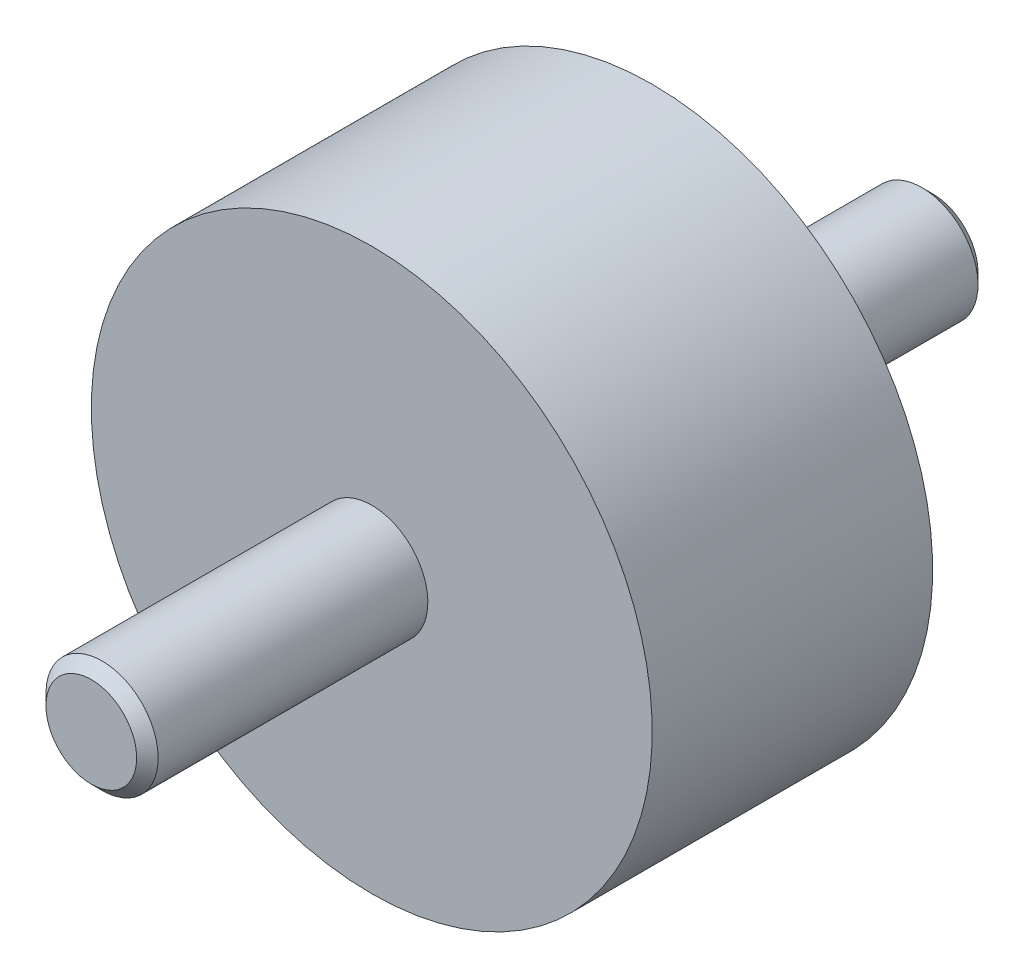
ISO-10303-21;
HEADER;
FILE_DESCRIPTION(('STEP AP214'),'2;1');
FILE_NAME('part.step','',(''),(''),'','','');
FILE_SCHEMA(('AUTOMOTIVE_DESIGN { 1 0 10303 214 1 1 1 1 }'));
ENDSEC;
DATA;
#1=APPLICATION_CONTEXT('core data for automotive mechanical design processes');
#2=APPLICATION_PROTOCOL_DEFINITION('international standard','automotive_design',2000,#1);
#3=PRODUCT_CONTEXT('',#1,'mechanical');
#4=PRODUCT('Part','Part','',(#3));
#5=PRODUCT_RELATED_PRODUCT_CATEGORY('part','',(#4));
#6=PRODUCT_DEFINITION_FORMATION('','',#4);
#7=PRODUCT_DEFINITION_CONTEXT('part definition',#1,'design');
#8=PRODUCT_DEFINITION('design','',#6,#7);
#9=PRODUCT_DEFINITION_SHAPE('','',#8);
#10=(LENGTH_UNIT() NAMED_UNIT(*) SI_UNIT(.MILLI.,.METRE.));
#11=(NAMED_UNIT(*) PLANE_ANGLE_UNIT() SI_UNIT($,.RADIAN.));
#12=(NAMED_UNIT(*) SI_UNIT($,.STERADIAN.) SOLID_ANGLE_UNIT());
#13=UNCERTAINTY_MEASURE_WITH_UNIT(LENGTH_MEASURE(1.E-05),#10,'distance_accuracy_value','');
#14=(GEOMETRIC_REPRESENTATION_CONTEXT(3) GLOBAL_UNCERTAINTY_ASSIGNED_CONTEXT((#13)) GLOBAL_UNIT_ASSIGNED_CONTEXT((#10,
#11,#12)) REPRESENTATION_CONTEXT('',''));
#15=CARTESIAN_POINT('',(0.,0.,0.));
#16=DIRECTION('',(0.,0.,1.));
#17=DIRECTION('',(1.,0.,0.));
#18=AXIS2_PLACEMENT_3D('',#15,#16,#17);
#19=CARTESIAN_POINT('',(18.666666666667,0.,20.));
#20=DIRECTION('',(0.,0.,1.));
#21=DIRECTION('',(0.,-1.,0.));
#22=AXIS2_PLACEMENT_3D('',#19,#20,#21);
#23=PLANE('',#22);
#24=CARTESIAN_POINT('',(0.,0.,20.));
#25=DIRECTION('',(0.,0.,1.));
#26=DIRECTION('',(0.,-1.,0.));
#27=AXIS2_PLACEMENT_3D('',#24,#25,#26);
#28=CIRCLE('',#27,4.);
#29=CARTESIAN_POINT('',(0.,-4.,20.));
#30=VERTEX_POINT('',#29);
#31=EDGE_CURVE('E8',#30,#30,#28,.T.);
#32=ORIENTED_EDGE('',*,*,#31,.F.);
#33=EDGE_LOOP('',(#32));
#34=FACE_BOUND('',#33,.T.);
#35=CARTESIAN_POINT('',(0.,0.,20.));
#36=DIRECTION('',(0.,0.,1.));
#37=DIRECTION('',(0.,-1.,0.));
#38=AXIS2_PLACEMENT_3D('',#35,#36,#37);
#39=CIRCLE('',#38,20.);
#40=CARTESIAN_POINT('',(0.,-20.,20.));
#41=VERTEX_POINT('',#40);
#42=EDGE_CURVE('E22',#41,#41,#39,.T.);
#43=ORIENTED_EDGE('',*,*,#42,.T.);
#44=EDGE_LOOP('',(#43));
#45=FACE_BOUND('',#44,.T.);
#46=ADVANCED_FACE('F12',(#34,#45),#23,.T.);
#47=CARTESIAN_POINT('',(0.,0.,0.66666666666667));
#48=DIRECTION('',(0.,0.,1.));
#49=DIRECTION('',(0.,-1.,0.));
#50=AXIS2_PLACEMENT_3D('',#47,#48,#49);
#51=CYLINDRICAL_SURFACE('',#50,20.);
#52=CARTESIAN_POINT('',(0.,0.,0.));
#53=DIRECTION('',(0.,0.,1.));
#54=DIRECTION('',(0.,-1.,0.));
#55=AXIS2_PLACEMENT_3D('',#52,#53,#54);
#56=CIRCLE('',#55,20.);
#57=CARTESIAN_POINT('',(0.,-20.,0.));
#58=VERTEX_POINT('',#57);
#59=EDGE_CURVE('E26',#58,#58,#56,.T.);
#60=ORIENTED_EDGE('',*,*,#59,.T.);
#61=EDGE_LOOP('',(#60));
#62=FACE_BOUND('',#61,.T.);
#63=ORIENTED_EDGE('',*,*,#42,.F.);
#64=EDGE_LOOP('',(#63));
#65=FACE_BOUND('',#64,.T.);
#66=ADVANCED_FACE('F57',(#62,#65),#51,.T.);
#67=CARTESIAN_POINT('',(20.,0.,0.));
#68=DIRECTION('',(0.,0.,-1.));
#69=DIRECTION('',(0.,1.,0.));
#70=AXIS2_PLACEMENT_3D('',#67,#68,#69);
#71=PLANE('',#70);
#72=CARTESIAN_POINT('',(0.,0.,0.));
#73=DIRECTION('',(0.,0.,-1.));
#74=DIRECTION('',(0.,1.,0.));
#75=AXIS2_PLACEMENT_3D('',#72,#73,#74);
#76=CIRCLE('',#75,4.);
#77=CARTESIAN_POINT('',(0.,4.,0.));
#78=VERTEX_POINT('',#77);
#79=EDGE_CURVE('E18',#78,#78,#76,.T.);
#80=ORIENTED_EDGE('',*,*,#79,.F.);
#81=EDGE_LOOP('',(#80));
#82=FACE_BOUND('',#81,.T.);
#83=ORIENTED_EDGE('',*,*,#59,.F.);
#84=EDGE_LOOP('',(#83));
#85=FACE_BOUND('',#84,.T.);
#86=ADVANCED_FACE('F62',(#82,#85),#71,.T.);
#87=CARTESIAN_POINT('',(0.,0.,-20.));
#88=DIRECTION('',(0.,0.,1.));
#89=DIRECTION('',(0.,-1.,0.));
#90=AXIS2_PLACEMENT_3D('',#87,#88,#89);
#91=CYLINDRICAL_SURFACE('',#90,4.);
#92=CARTESIAN_POINT('',(0.,0.,-19.233));
#93=DIRECTION('',(0.,0.,1.));
#94=DIRECTION('',(0.,-1.,0.));
#95=AXIS2_PLACEMENT_3D('',#92,#93,#94);
#96=CIRCLE('',#95,4.);
#97=CARTESIAN_POINT('',(0.,-4.,-19.233));
#98=VERTEX_POINT('',#97);
#99=EDGE_CURVE('E31',#98,#98,#96,.T.);
#100=ORIENTED_EDGE('',*,*,#99,.T.);
#101=EDGE_LOOP('',(#100));
#102=FACE_BOUND('',#101,.T.);
#103=ORIENTED_EDGE('',*,*,#79,.T.);
#104=EDGE_LOOP('',(#103));
#105=FACE_BOUND('',#104,.T.);
#106=ADVANCED_FACE('F70',(#102,#105),#91,.T.);
#107=CARTESIAN_POINT('',(0.,0.,-19.233));
#108=DIRECTION('',(0.,0.,1.));
#109=DIRECTION('',(0.,-1.,0.));
#110=AXIS2_PLACEMENT_3D('',#107,#108,#109);
#111=CONICAL_SURFACE('',#110,4.,0.785398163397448);
#112=CARTESIAN_POINT('',(0.,0.,-20.));
#113=DIRECTION('',(0.,0.,1.));
#114=DIRECTION('',(0.,-1.,0.));
#115=AXIS2_PLACEMENT_3D('',#112,#113,#114);
#116=CIRCLE('',#115,3.233);
#117=CARTESIAN_POINT('',(0.,-3.233,-20.));
#118=VERTEX_POINT('',#117);
#119=EDGE_CURVE('E34',#118,#118,#116,.T.);
#120=ORIENTED_EDGE('',*,*,#119,.T.);
#121=EDGE_LOOP('',(#120));
#122=FACE_BOUND('',#121,.T.);
#123=ORIENTED_EDGE('',*,*,#99,.F.);
#124=EDGE_LOOP('',(#123));
#125=FACE_BOUND('',#124,.T.);
#126=ADVANCED_FACE('F76',(#122,#125),#111,.T.);
#127=CARTESIAN_POINT('',(3.233,0.,-20.));
#128=DIRECTION('',(0.,0.,-1.));
#129=DIRECTION('',(0.,1.,0.));
#130=AXIS2_PLACEMENT_3D('',#127,#128,#129);
#131=PLANE('',#130);
#132=ORIENTED_EDGE('',*,*,#119,.F.);
#133=EDGE_LOOP('',(#132));
#134=FACE_BOUND('',#133,.T.);
#135=ADVANCED_FACE('F80',(#134),#131,.T.);
#136=CARTESIAN_POINT('',(0.,0.,40.));
#137=DIRECTION('',(0.,0.,1.));
#138=DIRECTION('',(0.,-1.,0.));
#139=AXIS2_PLACEMENT_3D('',#136,#137,#138);
#140=PLANE('',#139);
#141=CARTESIAN_POINT('',(0.,0.,40.));
#142=DIRECTION('',(0.,0.,1.));
#143=DIRECTION('',(0.,-1.,0.));
#144=AXIS2_PLACEMENT_3D('',#141,#142,#143);
#145=CIRCLE('',#144,3.233);
#146=CARTESIAN_POINT('',(0.,-3.233,40.));
#147=VERTEX_POINT('',#146);
#148=EDGE_CURVE('E37',#147,#147,#145,.T.);
#149=ORIENTED_EDGE('',*,*,#148,.T.);
#150=EDGE_LOOP('',(#149));
#151=FACE_BOUND('',#150,.T.);
#152=ADVANCED_FACE('F54',(#151),#140,.T.);
#153=CARTESIAN_POINT('',(0.,0.,40.));
#154=DIRECTION('',(0.,0.,-1.));
#155=DIRECTION('',(0.,1.,0.));
#156=AXIS2_PLACEMENT_3D('',#153,#154,#155);
#157=CONICAL_SURFACE('',#156,3.233,0.785398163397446);
#158=CARTESIAN_POINT('',(0.,0.,39.233));
#159=DIRECTION('',(0.,0.,1.));
#160=DIRECTION('',(0.,-1.,0.));
#161=AXIS2_PLACEMENT_3D('',#158,#159,#160);
#162=CIRCLE('',#161,4.);
#163=CARTESIAN_POINT('',(0.,-4.,39.233));
#164=VERTEX_POINT('',#163);
#165=EDGE_CURVE('E40',#164,#164,#162,.T.);
#166=ORIENTED_EDGE('',*,*,#165,.T.);
#167=EDGE_LOOP('',(#166));
#168=FACE_BOUND('',#167,.T.);
#169=ORIENTED_EDGE('',*,*,#148,.F.);
#170=EDGE_LOOP('',(#169));
#171=FACE_BOUND('',#170,.T.);
#172=ADVANCED_FACE('F44',(#168,#171),#157,.T.);
#173=CARTESIAN_POINT('',(0.,0.,20.));
#174=DIRECTION('',(0.,0.,1.));
#175=DIRECTION('',(0.,-1.,0.));
#176=AXIS2_PLACEMENT_3D('',#173,#174,#175);
#177=CYLINDRICAL_SURFACE('',#176,4.);
#178=ORIENTED_EDGE('',*,*,#31,.T.);
#179=EDGE_LOOP('',(#178));
#180=FACE_BOUND('',#179,.T.);
#181=ORIENTED_EDGE('',*,*,#165,.F.);
#182=EDGE_LOOP('',(#181));
#183=FACE_BOUND('',#182,.T.);
#184=ADVANCED_FACE('F47',(#180,#183),#177,.T.);
#185=CLOSED_SHELL('',(#46,#66,#86,#106,#126,#135,#152,#172,#184));
#186=MANIFOLD_SOLID_BREP('B1',#185);
#187=ADVANCED_BREP_SHAPE_REPRESENTATION('',(#18,#186),#14);
#188=SHAPE_DEFINITION_REPRESENTATION(#9,#187);
ENDSEC;
END-ISO-10303-21;
